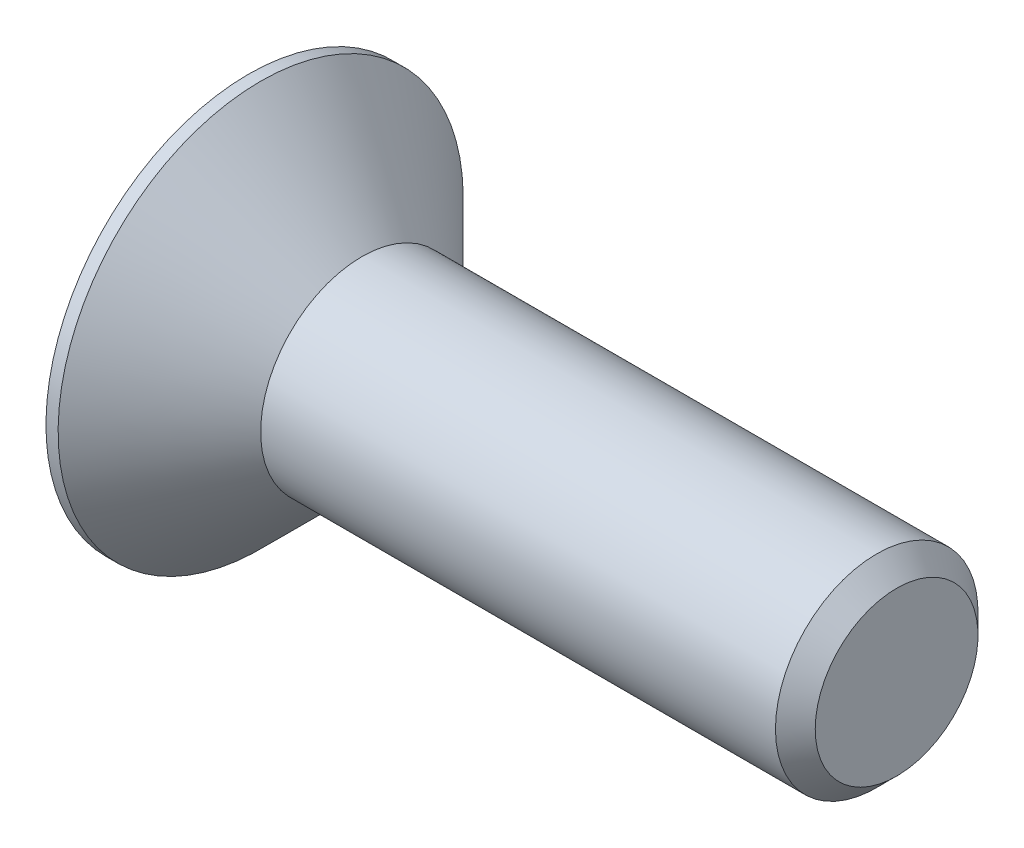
ISO-10303-21;
HEADER;
FILE_DESCRIPTION(('STEP AP214'),'2;1');
FILE_NAME('part.step','',(''),(''),'','','');
FILE_SCHEMA(('AUTOMOTIVE_DESIGN { 1 0 10303 214 1 1 1 1 }'));
ENDSEC;
DATA;
#1=APPLICATION_CONTEXT('core data for automotive mechanical design processes');
#2=APPLICATION_PROTOCOL_DEFINITION('international standard','automotive_design',2000,#1);
#3=PRODUCT_CONTEXT('',#1,'mechanical');
#4=PRODUCT('Part','Part','',(#3));
#5=PRODUCT_RELATED_PRODUCT_CATEGORY('part','',(#4));
#6=PRODUCT_DEFINITION_FORMATION('','',#4);
#7=PRODUCT_DEFINITION_CONTEXT('part definition',#1,'design');
#8=PRODUCT_DEFINITION('design','',#6,#7);
#9=PRODUCT_DEFINITION_SHAPE('','',#8);
#10=(LENGTH_UNIT() NAMED_UNIT(*) SI_UNIT(.MILLI.,.METRE.));
#11=(NAMED_UNIT(*) PLANE_ANGLE_UNIT() SI_UNIT($,.RADIAN.));
#12=(NAMED_UNIT(*) SI_UNIT($,.STERADIAN.) SOLID_ANGLE_UNIT());
#13=UNCERTAINTY_MEASURE_WITH_UNIT(LENGTH_MEASURE(1.E-05),#10,'distance_accuracy_value','');
#14=(GEOMETRIC_REPRESENTATION_CONTEXT(3) GLOBAL_UNCERTAINTY_ASSIGNED_CONTEXT((#13)) GLOBAL_UNIT_ASSIGNED_CONTEXT((#10,
#11,#12)) REPRESENTATION_CONTEXT('',''));
#15=CARTESIAN_POINT('',(0.,0.,0.));
#16=DIRECTION('',(0.,0.,1.));
#17=DIRECTION('',(1.,0.,0.));
#18=AXIS2_PLACEMENT_3D('',#15,#16,#17);
#19=CARTESIAN_POINT('',(0.,-1.5,0.866025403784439));
#20=DIRECTION('',(0.,-0.5,0.866025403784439));
#21=DIRECTION('',(0.,-0.866025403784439,-0.5));
#22=AXIS2_PLACEMENT_3D('',#19,#20,#21);
#23=PLANE('',#22);
#24=DIRECTION('',(1.,0.,0.));
#25=VECTOR('',#24,1.);
#26=CARTESIAN_POINT('',(0.,-1.5,0.866025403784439));
#27=LINE('',#26,#25);
#28=CARTESIAN_POINT('',(2.30000000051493,-1.50000000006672,0.866025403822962));
#29=VERTEX_POINT('',#28);
#30=CARTESIAN_POINT('',(0.,-1.5,0.866025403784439));
#31=VERTEX_POINT('',#30);
#32=EDGE_CURVE('E93',#29,#31,#27,.F.);
#33=ORIENTED_EDGE('',*,*,#32,.T.);
#34=DIRECTION('',(0.,-0.866025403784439,-0.5));
#35=VECTOR('',#34,1.);
#36=CARTESIAN_POINT('',(0.,-1.5,0.866025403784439));
#37=LINE('',#36,#35);
#38=CARTESIAN_POINT('',(0.,0.,1.73205080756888));
#39=VERTEX_POINT('',#38);
#40=EDGE_CURVE('E97',#39,#31,#37,.T.);
#41=ORIENTED_EDGE('',*,*,#40,.F.);
#42=DIRECTION('',(1.,0.,0.));
#43=VECTOR('',#42,1.);
#44=CARTESIAN_POINT('',(0.,0.,1.73205080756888));
#45=LINE('',#44,#43);
#46=CARTESIAN_POINT('',(2.3000000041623,-1.15760500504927E-08,1.73205080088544));
#47=VERTEX_POINT('',#46);
#48=EDGE_CURVE('E96',#39,#47,#45,.T.);
#49=ORIENTED_EDGE('',*,*,#48,.T.);
#50=CARTESIAN_POINT('',(2.30000000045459,-1.50000000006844,0.866025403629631));
#51=CARTESIAN_POINT('',(2.32197834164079,-1.43408408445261,0.904081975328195));
#52=CARTESIAN_POINT('',(2.34196649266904,-1.36759918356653,0.942467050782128));
#53=CARTESIAN_POINT('',(2.37685520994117,-1.23347824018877,1.01990181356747));
#54=CARTESIAN_POINT('',(2.39174343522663,-1.1658398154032,1.0589528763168));
#55=CARTESIAN_POINT('',(2.41491803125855,-1.03140117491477,1.13657106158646));
#56=CARTESIAN_POINT('',(2.42335865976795,-0.964621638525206,1.17512624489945));
#57=CARTESIAN_POINT('',(2.43343312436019,-0.830748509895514,1.25241793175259));
#58=CARTESIAN_POINT('',(2.43507530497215,-0.76365540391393,1.29115415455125));
#59=CARTESIAN_POINT('',(2.43165028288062,-0.638299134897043,1.3635286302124));
#60=CARTESIAN_POINT('',(2.42742403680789,-0.580017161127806,1.39717774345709));
#61=CARTESIAN_POINT('',(2.41403202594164,-0.463832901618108,1.4642567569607));
#62=CARTESIAN_POINT('',(2.4048616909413,-0.405931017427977,1.49768642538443));
#63=CARTESIAN_POINT('',(2.38193762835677,-0.289507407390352,1.56490362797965));
#64=CARTESIAN_POINT('',(2.36808677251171,-0.231000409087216,1.59868265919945));
#65=CARTESIAN_POINT('',(2.33665118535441,-0.114858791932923,1.66573705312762));
#66=CARTESIAN_POINT('',(2.31907383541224,-0.0572226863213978,1.69901327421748));
#67=CARTESIAN_POINT('',(2.30000000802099,-2.31520999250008E-08,1.73205079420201));
#68=B_SPLINE_CURVE_WITH_KNOTS('',3,(#50,#51,#52,#53,#54,#55,#56,#57,#58,#59,#60,#61,#62,#63,#64,
#65,#66,#67),.UNSPECIFIED.,.F.,.F.,(4,2,2,2,2,2,2,2,4),(0.,0.237762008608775,0.476095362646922,
0.708530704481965,0.940680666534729,1.14278083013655,1.34506813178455,1.55184119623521,
1.75820845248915),.UNSPECIFIED.);
#69=EDGE_CURVE('E20',#29,#47,#68,.T.);
#70=ORIENTED_EDGE('',*,*,#69,.F.);
#71=EDGE_LOOP('',(#33,#41,#49,#70));
#72=FACE_BOUND('',#71,.T.);
#73=ADVANCED_FACE('F16',(#72),#23,.F.);
#74=CARTESIAN_POINT('',(0.,-1.5,-0.866025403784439));
#75=DIRECTION('',(0.,-1.,0.));
#76=DIRECTION('',(0.,0.,-1.));
#77=AXIS2_PLACEMENT_3D('',#74,#75,#76);
#78=PLANE('',#77);
#79=DIRECTION('',(1.,0.,0.));
#80=VECTOR('',#79,1.);
#81=CARTESIAN_POINT('',(0.,-1.5,-0.866025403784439));
#82=LINE('',#81,#80);
#83=CARTESIAN_POINT('',(2.29999999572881,-1.5,-0.86602542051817));
#84=VERTEX_POINT('',#83);
#85=CARTESIAN_POINT('',(0.,-1.5,-0.866025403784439));
#86=VERTEX_POINT('',#85);
#87=EDGE_CURVE('E108',#84,#86,#82,.F.);
#88=ORIENTED_EDGE('',*,*,#87,.T.);
#89=DIRECTION('',(0.,0.,-1.));
#90=VECTOR('',#89,1.);
#91=CARTESIAN_POINT('',(0.,-1.5,-0.866025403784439));
#92=LINE('',#91,#90);
#93=EDGE_CURVE('E88',#31,#86,#92,.T.);
#94=ORIENTED_EDGE('',*,*,#93,.F.);
#95=ORIENTED_EDGE('',*,*,#32,.F.);
#96=CARTESIAN_POINT('',(2.29999999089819,-1.5,-0.8660254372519));
#97=CARTESIAN_POINT('',(2.32052466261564,-1.5,-0.794933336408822));
#98=CARTESIAN_POINT('',(2.33931557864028,-1.5,-0.723278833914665));
#99=CARTESIAN_POINT('',(2.37252619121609,-1.5,-0.57880585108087));
#100=CARTESIAN_POINT('',(2.38693610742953,-1.5,-0.505985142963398));
#101=CARTESIAN_POINT('',(2.41010899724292,-1.5,-0.361160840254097));
#102=CARTESIAN_POINT('',(2.41899551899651,-1.5,-0.289177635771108));
#103=CARTESIAN_POINT('',(2.43092514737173,-1.5,-0.144795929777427));
#104=CARTESIAN_POINT('',(2.43397459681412,-1.5,-0.072397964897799));
#105=CARTESIAN_POINT('',(2.43397459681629,-1.5,0.0723979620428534));
#106=CARTESIAN_POINT('',(2.43092514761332,-1.5,0.144795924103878));
#107=CARTESIAN_POINT('',(2.41899552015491,-1.5,0.289177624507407));
#108=CARTESIAN_POINT('',(2.41010899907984,-1.5,0.361160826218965));
#109=CARTESIAN_POINT('',(2.38693611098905,-1.5,0.50598512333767));
#110=CARTESIAN_POINT('',(2.37252619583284,-1.5,0.578805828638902));
#111=CARTESIAN_POINT('',(2.33931558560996,-1.5,0.723278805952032));
#112=CARTESIAN_POINT('',(2.32052467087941,-1.5,0.794933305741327));
#113=CARTESIAN_POINT('',(2.30000000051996,-1.5,0.866025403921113));
#114=B_SPLINE_CURVE_WITH_KNOTS('',3,(#96,#97,#98,#99,#100,#101,#102,#103,#104,#105,#106,#107,
#108,#109,#110,#111,#112,#113),.UNSPECIFIED.,.F.,.F.,(4,2,2,2,2,2,2,2,4),(0.,0.222055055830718,
0.444602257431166,0.661973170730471,0.879107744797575,1.09624231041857,1.31361321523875,
1.53616040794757,1.75821545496),.UNSPECIFIED.);
#115=EDGE_CURVE('E75',#84,#29,#114,.T.);
#116=ORIENTED_EDGE('',*,*,#115,.F.);
#117=EDGE_LOOP('',(#88,#94,#95,#116));
#118=FACE_BOUND('',#117,.T.);
#119=ADVANCED_FACE('F98',(#118),#78,.F.);
#120=CARTESIAN_POINT('',(0.,0.,1.73205080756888));
#121=DIRECTION('',(0.,0.500000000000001,0.866025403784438));
#122=DIRECTION('',(0.,-0.866025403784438,0.500000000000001));
#123=AXIS2_PLACEMENT_3D('',#120,#121,#122);
#124=PLANE('',#123);
#125=ORIENTED_EDGE('',*,*,#48,.F.);
#126=DIRECTION('',(0.,-0.866025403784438,0.500000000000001));
#127=VECTOR('',#126,1.);
#128=CARTESIAN_POINT('',(0.,0.,1.73205080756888));
#129=LINE('',#128,#127);
#130=CARTESIAN_POINT('',(0.,1.5,0.866025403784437));
#131=VERTEX_POINT('',#130);
#132=EDGE_CURVE('E87',#131,#39,#129,.T.);
#133=ORIENTED_EDGE('',*,*,#132,.F.);
#134=DIRECTION('',(1.,0.,0.));
#135=VECTOR('',#134,1.);
#136=CARTESIAN_POINT('',(0.,1.5,0.866025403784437));
#137=LINE('',#136,#135);
#138=CARTESIAN_POINT('',(2.3000000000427,1.5000000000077,0.86602540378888));
#139=VERTEX_POINT('',#138);
#140=EDGE_CURVE('E112',#131,#139,#137,.T.);
#141=ORIENTED_EDGE('',*,*,#140,.T.);
#142=CARTESIAN_POINT('',(2.30000000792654,2.28687573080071E-08,1.73205079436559));
#143=CARTESIAN_POINT('',(2.32197834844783,0.0659159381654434,1.69399422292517));
#144=CARTESIAN_POINT('',(2.34196649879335,0.132400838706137,1.65560914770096));
#145=CARTESIAN_POINT('',(2.37685521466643,0.266521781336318,1.57817438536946));
#146=CARTESIAN_POINT('',(2.39174343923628,0.334160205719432,1.5391233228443));
#147=CARTESIAN_POINT('',(2.41491803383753,0.468598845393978,1.46150513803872));
#148=CARTESIAN_POINT('',(2.42335866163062,0.53537838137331,1.42294995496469));
#149=CARTESIAN_POINT('',(2.43343312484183,0.669251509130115,1.34565826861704));
#150=CARTESIAN_POINT('',(2.43507530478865,0.736344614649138,1.30692204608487));
#151=CARTESIAN_POINT('',(2.43165028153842,0.86170088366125,1.23454757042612));
#152=CARTESIAN_POINT('',(2.4274240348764,0.919982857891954,1.20089845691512));
#153=CARTESIAN_POINT('',(2.41403202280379,1.03616711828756,1.13381944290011));
#154=CARTESIAN_POINT('',(2.40486168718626,1.09406900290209,1.10038977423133));
#155=CARTESIAN_POINT('',(2.38193762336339,1.21049261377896,1.03317257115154));
#156=CARTESIAN_POINT('',(2.36808676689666,1.26899961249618,0.999393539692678));
#157=CARTESIAN_POINT('',(2.33665117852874,1.38514123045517,0.932339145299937));
#158=CARTESIAN_POINT('',(2.31907382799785,1.4427773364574,0.899062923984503));
#159=CARTESIAN_POINT('',(2.30000000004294,1.50000000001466,0.866025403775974));
#160=B_SPLINE_CURVE_WITH_KNOTS('',3,(#142,#143,#144,#145,#146,#147,#148,#149,#150,#151,#152,
#153,#154,#155,#156,#157,#158,#159),.UNSPECIFIED.,.F.,.F.,(4,2,2,2,2,2,2,2,4),(0.,
0.237762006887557,0.476095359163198,0.7085306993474,0.940680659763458,1.14278082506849,
1.34506812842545,1.55184119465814,1.75820845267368),.UNSPECIFIED.);
#161=EDGE_CURVE('E105',#47,#139,#160,.T.);
#162=ORIENTED_EDGE('',*,*,#161,.F.);
#163=EDGE_LOOP('',(#125,#133,#141,#162));
#164=FACE_BOUND('',#163,.T.);
#165=ADVANCED_FACE('F214',(#164),#124,.F.);
#166=CARTESIAN_POINT('',(0.,0.,-1.73205080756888));
#167=DIRECTION('',(0.,-0.5,-0.866025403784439));
#168=DIRECTION('',(0.,0.866025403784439,-0.5));
#169=AXIS2_PLACEMENT_3D('',#166,#167,#168);
#170=PLANE('',#169);
#171=DIRECTION('',(1.,0.,0.));
#172=VECTOR('',#171,1.);
#173=CARTESIAN_POINT('',(0.,0.,-1.73205080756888));
#174=LINE('',#173,#172);
#175=CARTESIAN_POINT('',(2.30000000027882,0.,-1.73205080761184));
#176=VERTEX_POINT('',#175);
#177=CARTESIAN_POINT('',(0.,0.,-1.73205080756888));
#178=VERTEX_POINT('',#177);
#179=EDGE_CURVE('E122',#176,#178,#174,.F.);
#180=ORIENTED_EDGE('',*,*,#179,.T.);
#181=DIRECTION('',(0.,0.866025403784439,-0.5));
#182=VECTOR('',#181,1.);
#183=CARTESIAN_POINT('',(0.,0.,-1.73205080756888));
#184=LINE('',#183,#182);
#185=EDGE_CURVE('E40',#86,#178,#184,.T.);
#186=ORIENTED_EDGE('',*,*,#185,.F.);
#187=ORIENTED_EDGE('',*,*,#87,.F.);
#188=CARTESIAN_POINT('',(2.30000000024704,9.27628703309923E-11,-1.73205080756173));
#189=CARTESIAN_POINT('',(2.32197834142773,-0.065915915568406,-1.69399423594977));
#190=CARTESIAN_POINT('',(2.34196649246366,-0.132400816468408,-1.65560916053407));
#191=CARTESIAN_POINT('',(2.37685520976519,-0.266521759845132,-1.57817439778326));
#192=CARTESIAN_POINT('',(2.3917434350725,-0.334160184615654,-1.53912333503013));
#193=CARTESIAN_POINT('',(2.41491803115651,-0.468598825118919,-1.46150514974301));
#194=CARTESIAN_POINT('',(2.4233586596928,-0.535378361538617,-1.42294996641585));
#195=CARTESIAN_POINT('',(2.43343312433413,-0.669251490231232,-1.34565827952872));
#196=CARTESIAN_POINT('',(2.43507530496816,-0.736344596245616,-1.30692205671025));
#197=CARTESIAN_POINT('',(2.43165028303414,-0.861700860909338,-1.23454758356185));
#198=CARTESIAN_POINT('',(2.42742403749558,-0.919982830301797,-1.20089847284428));
#199=CARTESIAN_POINT('',(2.41403202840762,-1.03616708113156,-1.13381946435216));
#200=CARTESIAN_POINT('',(2.40486169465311,-1.09406896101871,-1.10038979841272));
#201=CARTESIAN_POINT('',(2.38193763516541,-1.21049256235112,-1.03317260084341));
#202=CARTESIAN_POINT('',(2.36808678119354,-1.26899955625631,-0.999393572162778));
#203=CARTESIAN_POINT('',(2.3366511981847,-1.38514116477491,-0.932339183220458));
#204=CARTESIAN_POINT('',(2.31907385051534,-1.4427772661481,-0.899062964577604));
#205=CARTESIAN_POINT('',(2.30000002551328,-1.49999992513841,-0.866025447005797));
#206=B_SPLINE_CURVE_WITH_KNOTS('',3,(#188,#189,#190,#191,#192,#193,#194,#195,#196,#197,#198,
#199,#200,#201,#202,#203,#204,#205),.UNSPECIFIED.,.F.,.F.,(4,2,2,2,2,2,2,2,4),(0.,
0.237762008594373,0.476095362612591,0.708530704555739,0.940680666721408,1.14278081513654,
1.34506810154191,1.55184114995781,1.75820839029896),.UNSPECIFIED.);
#207=EDGE_CURVE('E82',#176,#84,#206,.T.);
#208=ORIENTED_EDGE('',*,*,#207,.F.);
#209=EDGE_LOOP('',(#180,#186,#187,#208));
#210=FACE_BOUND('',#209,.T.);
#211=ADVANCED_FACE('F210',(#210),#170,.F.);
#212=CARTESIAN_POINT('',(0.,1.5,0.866025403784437));
#213=DIRECTION('',(0.,1.,0.));
#214=DIRECTION('',(0.,0.,1.));
#215=AXIS2_PLACEMENT_3D('',#212,#213,#214);
#216=PLANE('',#215);
#217=ORIENTED_EDGE('',*,*,#140,.F.);
#218=DIRECTION('',(0.,0.,1.));
#219=VECTOR('',#218,1.);
#220=CARTESIAN_POINT('',(0.,1.5,0.866025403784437));
#221=LINE('',#220,#219);
#222=CARTESIAN_POINT('',(0.,1.5,-0.866025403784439));
#223=VERTEX_POINT('',#222);
#224=EDGE_CURVE('E116',#223,#131,#221,.T.);
#225=ORIENTED_EDGE('',*,*,#224,.F.);
#226=DIRECTION('',(1.,0.,0.));
#227=VECTOR('',#226,1.);
#228=CARTESIAN_POINT('',(0.,1.5,-0.866025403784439));
#229=LINE('',#228,#227);
#230=CARTESIAN_POINT('',(2.30000001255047,1.5,-0.866025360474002));
#231=VERTEX_POINT('',#230);
#232=EDGE_CURVE('E119',#223,#231,#229,.T.);
#233=ORIENTED_EDGE('',*,*,#232,.T.);
#234=CARTESIAN_POINT('',(2.30000000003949,1.4999999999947,0.866025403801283));
#235=CARTESIAN_POINT('',(2.32052467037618,1.49999999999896,0.794933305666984));
#236=CARTESIAN_POINT('',(2.33931558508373,1.49999999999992,0.723278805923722));
#237=CARTESIAN_POINT('',(2.37252619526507,1.50000000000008,0.578805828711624));
#238=CARTESIAN_POINT('',(2.38693611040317,1.49999999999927,0.505985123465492));
#239=CARTESIAN_POINT('',(2.41010899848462,1.50000000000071,0.3611608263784));
#240=CARTESIAN_POINT('',(2.41899551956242,1.5000000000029,0.289177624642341));
#241=CARTESIAN_POINT('',(2.43092514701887,1.49999999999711,0.144795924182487));
#242=CARTESIAN_POINT('',(2.43397459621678,1.49999999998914,0.0723979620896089));
#243=CARTESIAN_POINT('',(2.43397459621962,1.49999999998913,-0.0723979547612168));
#244=CARTESIAN_POINT('',(2.43092514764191,1.49999999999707,-0.144795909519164));
#245=CARTESIAN_POINT('',(2.41899552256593,1.50000000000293,-0.289177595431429));
#246=CARTESIAN_POINT('',(2.4101090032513,1.50000000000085,-0.361160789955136));
#247=CARTESIAN_POINT('',(2.38693611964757,1.49999999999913,-0.505985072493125));
#248=CARTESIAN_POINT('',(2.37252620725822,1.49999999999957,-0.578805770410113));
#249=CARTESIAN_POINT('',(2.33931560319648,1.50000000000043,-0.723278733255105));
#250=CARTESIAN_POINT('',(2.32052469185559,1.50000000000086,-0.794933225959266));
#251=CARTESIAN_POINT('',(2.30000002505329,1.5,-0.866025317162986));
#252=B_SPLINE_CURVE_WITH_KNOTS('',3,(#234,#235,#236,#237,#238,#239,#240,#241,#242,#243,#244,
#245,#246,#247,#248,#249,#250,#251),.UNSPECIFIED.,.F.,.F.,(4,2,2,2,2,2,2,2,4),(0.,
0.222055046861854,0.444602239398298,0.661973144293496,0.879107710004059,1.09624225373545,
1.31361313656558,1.53616030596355,1.75821532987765),.UNSPECIFIED.);
#253=EDGE_CURVE('E115',#139,#231,#252,.T.);
#254=ORIENTED_EDGE('',*,*,#253,.F.);
#255=EDGE_LOOP('',(#217,#225,#233,#254));
#256=FACE_BOUND('',#255,.T.);
#257=ADVANCED_FACE('F207',(#256),#216,.F.);
#258=CARTESIAN_POINT('',(3.3000000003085,-5.11590769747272E-10,0.));
#259=DIRECTION('',(-1.,0.,0.));
#260=DIRECTION('',(0.,0.,1.));
#261=AXIS2_PLACEMENT_3D('',#258,#259,#260);
#262=CONICAL_SURFACE('',#261,0.,1.04719755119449);
#263=ORIENTED_EDGE('',*,*,#115,.T.);
#264=ORIENTED_EDGE('',*,*,#69,.T.);
#265=ORIENTED_EDGE('',*,*,#161,.T.);
#266=ORIENTED_EDGE('',*,*,#253,.T.);
#267=CARTESIAN_POINT('',(2.29999999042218,1.50000002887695,-0.866025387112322));
#268=CARTESIAN_POINT('',(2.3219783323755,1.43408411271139,-0.904081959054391));
#269=CARTESIAN_POINT('',(2.34196648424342,1.36759921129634,-0.942467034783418));
#270=CARTESIAN_POINT('',(2.37685520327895,1.23347826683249,-1.01990179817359));
#271=CARTESIAN_POINT('',(2.39174342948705,1.16583984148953,-1.05895286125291));
#272=CARTESIAN_POINT('',(2.41491802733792,1.03140119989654,-1.13657104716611));
#273=CARTESIAN_POINT('',(2.42335865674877,0.964621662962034,-1.1751262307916));
#274=CARTESIAN_POINT('',(2.43343312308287,0.830748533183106,-1.25241791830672));
#275=CARTESIAN_POINT('',(2.43507530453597,0.763655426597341,-1.29115414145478));
#276=CARTESIAN_POINT('',(2.43165028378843,0.638299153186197,-1.36352861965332));
#277=CARTESIAN_POINT('',(2.42742403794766,0.580017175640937,-1.39717773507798));
#278=CARTESIAN_POINT('',(2.41403202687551,0.463832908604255,-1.4642567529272));
#279=CARTESIAN_POINT('',(2.40486169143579,0.40593102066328,-1.49768642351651));
#280=CARTESIAN_POINT('',(2.38193762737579,0.289507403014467,-1.56490363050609));
#281=CARTESIAN_POINT('',(2.36808677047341,0.231000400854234,-1.59868266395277));
#282=CARTESIAN_POINT('',(2.33665118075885,0.114858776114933,-1.66573706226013));
#283=CARTESIAN_POINT('',(2.31907382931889,0.0572226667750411,-1.69901328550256));
#284=CARTESIAN_POINT('',(2.30000000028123,-6.7177757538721E-11,-1.73205080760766));
#285=B_SPLINE_CURVE_WITH_KNOTS('',3,(#267,#268,#269,#270,#271,#272,#273,#274,#275,#276,#277,
#278,#279,#280,#281,#282,#283,#284),.UNSPECIFIED.,.F.,.F.,(4,2,2,2,2,2,2,2,4),(0.,
0.237762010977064,0.476095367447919,0.708530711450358,0.940680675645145,1.14278085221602,
1.34506816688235,1.55184124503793,1.75820851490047),.UNSPECIFIED.);
#286=EDGE_CURVE('E121',#231,#176,#285,.T.);
#287=ORIENTED_EDGE('',*,*,#286,.T.);
#288=ORIENTED_EDGE('',*,*,#207,.T.);
#289=EDGE_LOOP('',(#263,#264,#265,#266,#287,#288));
#290=FACE_BOUND('',#289,.T.);
#291=CARTESIAN_POINT('',(3.30000000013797,-1.98951966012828E-10,0.));
#292=VERTEX_POINT('',#291);
#293=VERTEX_LOOP('',#292);
#294=FACE_BOUND('',#293,.T.);
#295=ADVANCED_FACE('F77',(#290,#294),#262,.F.);
#296=CARTESIAN_POINT('',(0.,1.5,-0.866025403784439));
#297=DIRECTION('',(0.,0.5,-0.866025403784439));
#298=DIRECTION('',(0.,0.866025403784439,0.5));
#299=AXIS2_PLACEMENT_3D('',#296,#297,#298);
#300=PLANE('',#299);
#301=ORIENTED_EDGE('',*,*,#232,.F.);
#302=DIRECTION('',(0.,0.866025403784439,0.5));
#303=VECTOR('',#302,1.);
#304=CARTESIAN_POINT('',(0.,0.,-1.73205080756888));
#305=LINE('',#304,#303);
#306=EDGE_CURVE('E138',#178,#223,#305,.T.);
#307=ORIENTED_EDGE('',*,*,#306,.F.);
#308=ORIENTED_EDGE('',*,*,#179,.F.);
#309=ORIENTED_EDGE('',*,*,#286,.F.);
#310=EDGE_LOOP('',(#301,#307,#308,#309));
#311=FACE_BOUND('',#310,.T.);
#312=ADVANCED_FACE('F169',(#311),#300,.F.);
#313=CARTESIAN_POINT('',(0.,3.36602540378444,0.));
#314=DIRECTION('',(-1.,0.,0.));
#315=DIRECTION('',(0.,-1.,0.));
#316=AXIS2_PLACEMENT_3D('',#313,#314,#315);
#317=PLANE('',#316);
#318=ORIENTED_EDGE('',*,*,#185,.T.);
#319=ORIENTED_EDGE('',*,*,#306,.T.);
#320=ORIENTED_EDGE('',*,*,#224,.T.);
#321=ORIENTED_EDGE('',*,*,#132,.T.);
#322=ORIENTED_EDGE('',*,*,#40,.T.);
#323=ORIENTED_EDGE('',*,*,#93,.T.);
#324=EDGE_LOOP('',(#318,#319,#320,#321,#322,#323));
#325=FACE_BOUND('',#324,.T.);
#326=CARTESIAN_POINT('',(0.,0.,0.));
#327=DIRECTION('',(1.,0.,0.));
#328=DIRECTION('',(0.,1.,0.));
#329=AXIS2_PLACEMENT_3D('',#326,#327,#328);
#330=CIRCLE('',#329,5.00000000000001);
#331=CARTESIAN_POINT('',(0.,5.00000000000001,0.));
#332=VERTEX_POINT('',#331);
#333=EDGE_CURVE('E134',#332,#332,#330,.T.);
#334=ORIENTED_EDGE('',*,*,#333,.F.);
#335=EDGE_LOOP('',(#334));
#336=FACE_BOUND('',#335,.T.);
#337=ADVANCED_FACE('F173',(#325,#336),#317,.T.);
#338=CARTESIAN_POINT('',(0.14999999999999,0.,0.));
#339=DIRECTION('',(1.,0.,0.));
#340=DIRECTION('',(0.,1.,0.));
#341=AXIS2_PLACEMENT_3D('',#338,#339,#340);
#342=CYLINDRICAL_SURFACE('',#341,5.00000000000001);
#343=ORIENTED_EDGE('',*,*,#333,.T.);
#344=EDGE_LOOP('',(#343));
#345=FACE_BOUND('',#344,.T.);
#346=CARTESIAN_POINT('',(0.300000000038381,0.,0.));
#347=DIRECTION('',(-1.,0.,0.));
#348=DIRECTION('',(0.,1.,0.));
#349=AXIS2_PLACEMENT_3D('',#346,#347,#348);
#350=CIRCLE('',#349,4.99999999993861);
#351=CARTESIAN_POINT('',(0.300000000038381,4.99999999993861,0.));
#352=VERTEX_POINT('',#351);
#353=EDGE_CURVE('E131',#352,#352,#350,.F.);
#354=ORIENTED_EDGE('',*,*,#353,.F.);
#355=EDGE_LOOP('',(#354));
#356=FACE_BOUND('',#355,.T.);
#357=ADVANCED_FACE('F177',(#345,#356),#342,.T.);
#358=CARTESIAN_POINT('',(16.,1.25,0.));
#359=DIRECTION('',(1.,0.,0.));
#360=DIRECTION('',(0.,1.,0.));
#361=AXIS2_PLACEMENT_3D('',#358,#359,#360);
#362=PLANE('',#361);
#363=CARTESIAN_POINT('',(16.0000000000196,0.,0.));
#364=DIRECTION('',(-1.,0.,0.));
#365=DIRECTION('',(0.,0.,1.));
#366=AXIS2_PLACEMENT_3D('',#363,#364,#365);
#367=CIRCLE('',#366,2.00923999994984);
#368=CARTESIAN_POINT('',(16.0000000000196,0.,2.00923999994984));
#369=VERTEX_POINT('',#368);
#370=EDGE_CURVE('E129',#369,#369,#367,.T.);
#371=ORIENTED_EDGE('',*,*,#370,.F.);
#372=EDGE_LOOP('',(#371));
#373=FACE_BOUND('',#372,.T.);
#374=ADVANCED_FACE('F180',(#373),#362,.T.);
#375=CARTESIAN_POINT('',(0.300000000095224,0.,0.));
#376=DIRECTION('',(-1.,0.,0.));
#377=DIRECTION('',(0.,0.,1.));
#378=AXIS2_PLACEMENT_3D('',#375,#376,#377);
#379=CONICAL_SURFACE('',#378,4.99999999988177,0.785398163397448);
#380=ORIENTED_EDGE('',*,*,#353,.T.);
#381=EDGE_LOOP('',(#380));
#382=FACE_BOUND('',#381,.T.);
#383=CARTESIAN_POINT('',(2.79999999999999,0.,0.));
#384=DIRECTION('',(1.,0.,0.));
#385=DIRECTION('',(0.,1.,0.));
#386=AXIS2_PLACEMENT_3D('',#383,#384,#385);
#387=CIRCLE('',#386,2.49999999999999);
#388=CARTESIAN_POINT('',(2.79999999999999,2.49999999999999,0.));
#389=VERTEX_POINT('',#388);
#390=EDGE_CURVE('E31',#389,#389,#387,.T.);
#391=ORIENTED_EDGE('',*,*,#390,.F.);
#392=EDGE_LOOP('',(#391));
#393=FACE_BOUND('',#392,.T.);
#394=ADVANCED_FACE('F184',(#382,#393),#379,.T.);
#395=CARTESIAN_POINT('',(15.5092400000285,0.,0.));
#396=DIRECTION('',(-1.,0.,0.));
#397=DIRECTION('',(0.,0.,1.));
#398=AXIS2_PLACEMENT_3D('',#395,#396,#397);
#399=CONICAL_SURFACE('',#398,2.49999999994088,0.785398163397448);
#400=CARTESIAN_POINT('',(15.50924,0.,0.));
#401=DIRECTION('',(1.,0.,0.));
#402=DIRECTION('',(0.,1.,0.));
#403=AXIS2_PLACEMENT_3D('',#400,#401,#402);
#404=CIRCLE('',#403,2.49999999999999);
#405=CARTESIAN_POINT('',(15.50924,2.49999999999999,0.));
#406=VERTEX_POINT('',#405);
#407=EDGE_CURVE('E10',#406,#406,#404,.F.);
#408=ORIENTED_EDGE('',*,*,#407,.F.);
#409=EDGE_LOOP('',(#408));
#410=FACE_BOUND('',#409,.T.);
#411=ORIENTED_EDGE('',*,*,#370,.T.);
#412=EDGE_LOOP('',(#411));
#413=FACE_BOUND('',#412,.T.);
#414=ADVANCED_FACE('F187',(#410,#413),#399,.T.);
#415=CARTESIAN_POINT('',(10.6,0.,0.));
#416=DIRECTION('',(1.,0.,0.));
#417=DIRECTION('',(0.,1.,0.));
#418=AXIS2_PLACEMENT_3D('',#415,#416,#417);
#419=CYLINDRICAL_SURFACE('',#418,2.49999999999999);
#420=ORIENTED_EDGE('',*,*,#390,.T.);
#421=EDGE_LOOP('',(#420));
#422=FACE_BOUND('',#421,.T.);
#423=ORIENTED_EDGE('',*,*,#407,.T.);
#424=EDGE_LOOP('',(#423));
#425=FACE_BOUND('',#424,.T.);
#426=ADVANCED_FACE('F18',(#422,#425),#419,.T.);
#427=CLOSED_SHELL('',(#73,#119,#165,#211,#257,#295,#312,#337,#357,#374,#394,#414,#426));
#428=MANIFOLD_SOLID_BREP('B1',#427);
#429=ADVANCED_BREP_SHAPE_REPRESENTATION('',(#18,#428),#14);
#430=SHAPE_DEFINITION_REPRESENTATION(#9,#429);
ENDSEC;
END-ISO-10303-21;
